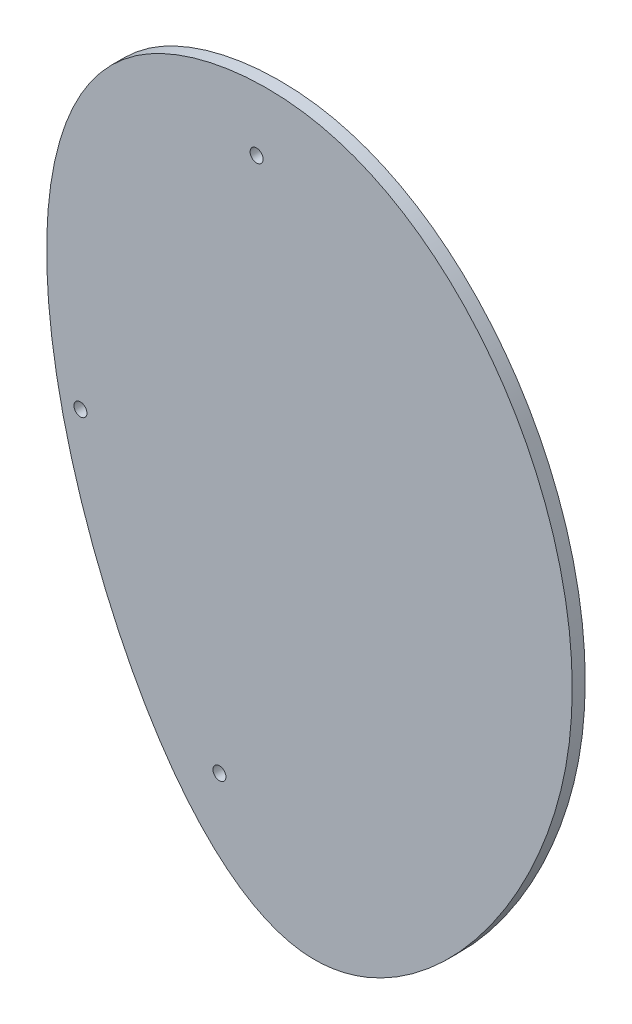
from build123d import *

# Parameters (mm, degrees)
SKETCH1_R           = 1.5875
BOSS_EXTRUDE1_DEPTH = 3.175


with BuildPart() as part:
    # Sketch1 → Boss-Extrude1 (new body)
    with BuildSketch(Plane.XY):
        with BuildLine():
            add(Edge.make_bspline(
                [(0, 177.8), (-13.471753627, 179.79344112), (-71.35315009, 169.65070047), (-65.79746727, 65.90032415), (2.519394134, -30.222129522), (96.583983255, 80.218987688), (42.490033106, 171.51266863), (0, 177.8)],
                knots=[0, 0, 0, 0, 0.0877803, 0.346466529, 0.510930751, 0.723140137, 1, 1, 1, 1], degree=3))
        make_face()
        with Locations((-11.60737998, 162.962327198)):
            Circle(SKETCH1_R, mode=Mode.SUBTRACT)
        with Locations((-20.686249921, 27.718471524)):
            Circle(SKETCH1_R, mode=Mode.SUBTRACT)
        with Locations((-54.647391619, 87.725967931)):
            Circle(SKETCH1_R, mode=Mode.SUBTRACT)
    extrude(amount=BOSS_EXTRUDE1_DEPTH)


solid = part.part
